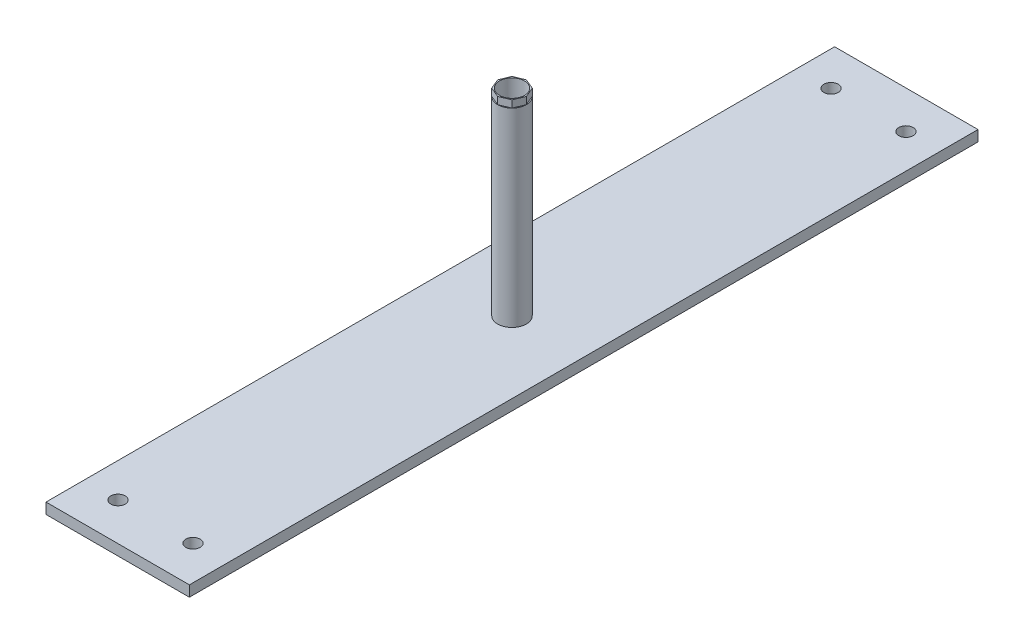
ISO-10303-21;
HEADER;
FILE_DESCRIPTION(('STEP AP214'),'2;1');
FILE_NAME('part.step','',(''),(''),'','','');
FILE_SCHEMA(('AUTOMOTIVE_DESIGN { 1 0 10303 214 1 1 1 1 }'));
ENDSEC;
DATA;
#1=APPLICATION_CONTEXT('core data for automotive mechanical design processes');
#2=APPLICATION_PROTOCOL_DEFINITION('international standard','automotive_design',2000,#1);
#3=PRODUCT_CONTEXT('',#1,'mechanical');
#4=PRODUCT('Part','Part','',(#3));
#5=PRODUCT_RELATED_PRODUCT_CATEGORY('part','',(#4));
#6=PRODUCT_DEFINITION_FORMATION('','',#4);
#7=PRODUCT_DEFINITION_CONTEXT('part definition',#1,'design');
#8=PRODUCT_DEFINITION('design','',#6,#7);
#9=PRODUCT_DEFINITION_SHAPE('','',#8);
#10=(LENGTH_UNIT() NAMED_UNIT(*) SI_UNIT(.MILLI.,.METRE.));
#11=(NAMED_UNIT(*) PLANE_ANGLE_UNIT() SI_UNIT($,.RADIAN.));
#12=(NAMED_UNIT(*) SI_UNIT($,.STERADIAN.) SOLID_ANGLE_UNIT());
#13=UNCERTAINTY_MEASURE_WITH_UNIT(LENGTH_MEASURE(1.E-05),#10,'distance_accuracy_value','');
#14=(GEOMETRIC_REPRESENTATION_CONTEXT(3) GLOBAL_UNCERTAINTY_ASSIGNED_CONTEXT((#13)) GLOBAL_UNIT_ASSIGNED_CONTEXT((#10,
#11,#12)) REPRESENTATION_CONTEXT('',''));
#15=CARTESIAN_POINT('',(0.,0.,0.));
#16=DIRECTION('',(0.,0.,1.));
#17=DIRECTION('',(1.,0.,0.));
#18=AXIS2_PLACEMENT_3D('',#15,#16,#17);
#19=CARTESIAN_POINT('',(0.,29.,0.));
#20=DIRECTION('',(0.,1.,0.));
#21=DIRECTION('',(0.,0.,1.));
#22=AXIS2_PLACEMENT_3D('',#19,#20,#21);
#23=PLANE('',#22);
#24=CARTESIAN_POINT('',(0.,29.,0.));
#25=DIRECTION('',(0.,1.,0.));
#26=DIRECTION('',(0.,0.,1.));
#27=AXIS2_PLACEMENT_3D('',#24,#25,#26);
#28=CIRCLE('',#27,1.75);
#29=CARTESIAN_POINT('',(0.,29.,1.75));
#30=VERTEX_POINT('',#29);
#31=EDGE_CURVE('E222',#30,#30,#28,.T.);
#32=ORIENTED_EDGE('',*,*,#31,.F.);
#33=EDGE_LOOP('',(#32));
#34=FACE_BOUND('',#33,.T.);
#35=DIRECTION('',(-0.382683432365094,0.,-0.923879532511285));
#36=VECTOR('',#35,1.);
#37=CARTESIAN_POINT('',(1.70710678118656,29.,-0.707106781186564));
#38=LINE('',#37,#36);
#39=CARTESIAN_POINT('',(2.00000000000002,29.,0.));
#40=VERTEX_POINT('',#39);
#41=CARTESIAN_POINT('',(1.41421356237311,29.,-1.41421356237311));
#42=VERTEX_POINT('',#41);
#43=EDGE_CURVE('E208',#40,#42,#38,.T.);
#44=ORIENTED_EDGE('',*,*,#43,.T.);
#45=DIRECTION('',(-0.923879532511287,0.,-0.38268343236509));
#46=VECTOR('',#45,1.);
#47=CARTESIAN_POINT('',(0.707106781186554,29.,-1.70710678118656));
#48=LINE('',#47,#46);
#49=CARTESIAN_POINT('',(0.,29.,-2.00000000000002));
#50=VERTEX_POINT('',#49);
#51=EDGE_CURVE('E177',#42,#50,#48,.T.);
#52=ORIENTED_EDGE('',*,*,#51,.T.);
#53=DIRECTION('',(-0.923879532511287,0.,0.38268343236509));
#54=VECTOR('',#53,1.);
#55=CARTESIAN_POINT('',(-0.707106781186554,29.,-1.70710678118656));
#56=LINE('',#55,#54);
#57=CARTESIAN_POINT('',(-1.41421356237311,29.,-1.41421356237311));
#58=VERTEX_POINT('',#57);
#59=EDGE_CURVE('E188',#50,#58,#56,.T.);
#60=ORIENTED_EDGE('',*,*,#59,.T.);
#61=DIRECTION('',(-0.38268343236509,0.,0.923879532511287));
#62=VECTOR('',#61,1.);
#63=CARTESIAN_POINT('',(-1.70710678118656,29.,-0.707106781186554));
#64=LINE('',#63,#62);
#65=CARTESIAN_POINT('',(-2.00000000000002,29.,0.));
#66=VERTEX_POINT('',#65);
#67=EDGE_CURVE('E524',#58,#66,#64,.T.);
#68=ORIENTED_EDGE('',*,*,#67,.T.);
#69=DIRECTION('',(0.38268343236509,0.,0.923879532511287));
#70=VECTOR('',#69,1.);
#71=CARTESIAN_POINT('',(-1.70710678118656,29.,0.707106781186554));
#72=LINE('',#71,#70);
#73=CARTESIAN_POINT('',(-1.41421356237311,29.,1.41421356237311));
#74=VERTEX_POINT('',#73);
#75=EDGE_CURVE('E539',#66,#74,#72,.T.);
#76=ORIENTED_EDGE('',*,*,#75,.T.);
#77=DIRECTION('',(0.923879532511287,0.,0.38268343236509));
#78=VECTOR('',#77,1.);
#79=CARTESIAN_POINT('',(-0.707106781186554,29.,1.70710678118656));
#80=LINE('',#79,#78);
#81=CARTESIAN_POINT('',(0.,29.,2.00000000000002));
#82=VERTEX_POINT('',#81);
#83=EDGE_CURVE('E549',#74,#82,#80,.T.);
#84=ORIENTED_EDGE('',*,*,#83,.T.);
#85=DIRECTION('',(0.923879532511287,0.,-0.38268343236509));
#86=VECTOR('',#85,1.);
#87=CARTESIAN_POINT('',(0.707106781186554,29.,1.70710678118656));
#88=LINE('',#87,#86);
#89=CARTESIAN_POINT('',(1.41421356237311,29.,1.41421356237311));
#90=VERTEX_POINT('',#89);
#91=EDGE_CURVE('E559',#82,#90,#88,.T.);
#92=ORIENTED_EDGE('',*,*,#91,.T.);
#93=DIRECTION('',(0.382683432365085,0.,-0.923879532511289));
#94=VECTOR('',#93,1.);
#95=CARTESIAN_POINT('',(1.70710678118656,29.,0.707106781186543));
#96=LINE('',#95,#94);
#97=EDGE_CURVE('E205',#90,#40,#96,.T.);
#98=ORIENTED_EDGE('',*,*,#97,.T.);
#99=EDGE_LOOP('',(#44,#52,#60,#68,#76,#84,#92,#98));
#100=FACE_BOUND('',#99,.T.);
#101=ADVANCED_FACE('F71',(#34,#100),#23,.T.);
#102=CARTESIAN_POINT('',(0.,29.,0.));
#103=DIRECTION('',(0.,-1.,0.));
#104=DIRECTION('',(0.,0.,-1.));
#105=AXIS2_PLACEMENT_3D('',#102,#103,#104);
#106=CYLINDRICAL_SURFACE('',#105,2.00000000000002);
#107=CARTESIAN_POINT('',(0.,1.5,0.));
#108=DIRECTION('',(0.,-1.,0.));
#109=DIRECTION('',(0.,0.,-1.));
#110=AXIS2_PLACEMENT_3D('',#107,#108,#109);
#111=CIRCLE('',#110,2.00000000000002);
#112=CARTESIAN_POINT('',(0.,1.5,-2.00000000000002));
#113=VERTEX_POINT('',#112);
#114=EDGE_CURVE('E12',#113,#113,#111,.F.);
#115=ORIENTED_EDGE('',*,*,#114,.T.);
#116=EDGE_LOOP('',(#115));
#117=FACE_BOUND('',#116,.T.);
#118=CARTESIAN_POINT('',(0.,28.,0.));
#119=DIRECTION('',(0.,1.,0.));
#120=DIRECTION('',(0.,0.,1.));
#121=AXIS2_PLACEMENT_3D('',#118,#119,#120);
#122=CIRCLE('',#121,2.00000000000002);
#123=CARTESIAN_POINT('',(1.41421356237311,28.,-1.41421356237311));
#124=VERTEX_POINT('',#123);
#125=CARTESIAN_POINT('',(0.,28.,-2.00000000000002));
#126=VERTEX_POINT('',#125);
#127=EDGE_CURVE('E187',#124,#126,#122,.T.);
#128=ORIENTED_EDGE('',*,*,#127,.F.);
#129=CARTESIAN_POINT('',(0.,28.,0.));
#130=DIRECTION('',(0.,1.,0.));
#131=DIRECTION('',(0.,0.,1.));
#132=AXIS2_PLACEMENT_3D('',#129,#130,#131);
#133=CIRCLE('',#132,2.00000000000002);
#134=CARTESIAN_POINT('',(2.00000000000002,28.,0.));
#135=VERTEX_POINT('',#134);
#136=EDGE_CURVE('E182',#135,#124,#133,.T.);
#137=ORIENTED_EDGE('',*,*,#136,.F.);
#138=CARTESIAN_POINT('',(0.,28.,0.));
#139=DIRECTION('',(0.,1.,0.));
#140=DIRECTION('',(0.,0.,1.));
#141=AXIS2_PLACEMENT_3D('',#138,#139,#140);
#142=CIRCLE('',#141,2.00000000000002);
#143=CARTESIAN_POINT('',(1.41421356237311,28.,1.41421356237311));
#144=VERTEX_POINT('',#143);
#145=EDGE_CURVE('E215',#144,#135,#142,.T.);
#146=ORIENTED_EDGE('',*,*,#145,.F.);
#147=CARTESIAN_POINT('',(0.,28.,0.));
#148=DIRECTION('',(0.,1.,0.));
#149=DIRECTION('',(0.,0.,1.));
#150=AXIS2_PLACEMENT_3D('',#147,#148,#149);
#151=CIRCLE('',#150,2.00000000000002);
#152=CARTESIAN_POINT('',(0.,28.,2.00000000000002));
#153=VERTEX_POINT('',#152);
#154=EDGE_CURVE('E85',#153,#144,#151,.T.);
#155=ORIENTED_EDGE('',*,*,#154,.F.);
#156=CARTESIAN_POINT('',(0.,28.,0.));
#157=DIRECTION('',(0.,1.,0.));
#158=DIRECTION('',(0.,0.,1.));
#159=AXIS2_PLACEMENT_3D('',#156,#157,#158);
#160=CIRCLE('',#159,2.00000000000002);
#161=CARTESIAN_POINT('',(-1.41421356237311,28.,1.41421356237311));
#162=VERTEX_POINT('',#161);
#163=EDGE_CURVE('E552',#162,#153,#160,.T.);
#164=ORIENTED_EDGE('',*,*,#163,.F.);
#165=CARTESIAN_POINT('',(0.,28.,0.));
#166=DIRECTION('',(0.,1.,0.));
#167=DIRECTION('',(0.,0.,1.));
#168=AXIS2_PLACEMENT_3D('',#165,#166,#167);
#169=CIRCLE('',#168,2.00000000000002);
#170=CARTESIAN_POINT('',(-2.00000000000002,28.,0.));
#171=VERTEX_POINT('',#170);
#172=EDGE_CURVE('E542',#171,#162,#169,.T.);
#173=ORIENTED_EDGE('',*,*,#172,.F.);
#174=CARTESIAN_POINT('',(0.,28.,0.));
#175=DIRECTION('',(0.,1.,0.));
#176=DIRECTION('',(0.,0.,1.));
#177=AXIS2_PLACEMENT_3D('',#174,#175,#176);
#178=CIRCLE('',#177,2.00000000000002);
#179=CARTESIAN_POINT('',(-1.41421356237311,28.,-1.41421356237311));
#180=VERTEX_POINT('',#179);
#181=EDGE_CURVE('E533',#180,#171,#178,.T.);
#182=ORIENTED_EDGE('',*,*,#181,.F.);
#183=CARTESIAN_POINT('',(0.,28.,0.));
#184=DIRECTION('',(0.,1.,0.));
#185=DIRECTION('',(0.,0.,1.));
#186=AXIS2_PLACEMENT_3D('',#183,#184,#185);
#187=CIRCLE('',#186,2.00000000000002);
#188=EDGE_CURVE('E198',#126,#180,#187,.T.);
#189=ORIENTED_EDGE('',*,*,#188,.F.);
#190=EDGE_LOOP('',(#128,#137,#146,#155,#164,#173,#182,#189));
#191=FACE_BOUND('',#190,.T.);
#192=ADVANCED_FACE('F193',(#117,#191),#106,.T.);
#193=CARTESIAN_POINT('',(0.,1.5,0.));
#194=DIRECTION('',(0.,-1.,0.));
#195=DIRECTION('',(0.,0.,-1.));
#196=AXIS2_PLACEMENT_3D('',#193,#194,#195);
#197=PLANE('',#196);
#198=DIRECTION('',(0.,0.,-1.));
#199=VECTOR('',#198,1.);
#200=CARTESIAN_POINT('',(10.,1.5,55.));
#201=LINE('',#200,#199);
#202=CARTESIAN_POINT('',(10.,1.5,55.));
#203=VERTEX_POINT('',#202);
#204=CARTESIAN_POINT('',(10.,1.5,-55.));
#205=VERTEX_POINT('',#204);
#206=EDGE_CURVE('E254',#203,#205,#201,.T.);
#207=ORIENTED_EDGE('',*,*,#206,.T.);
#208=DIRECTION('',(-1.,0.,0.));
#209=VECTOR('',#208,1.);
#210=CARTESIAN_POINT('',(-10.,1.5,-55.));
#211=LINE('',#210,#209);
#212=CARTESIAN_POINT('',(-10.,1.5,-55.));
#213=VERTEX_POINT('',#212);
#214=EDGE_CURVE('E123',#205,#213,#211,.T.);
#215=ORIENTED_EDGE('',*,*,#214,.T.);
#216=DIRECTION('',(0.,0.,1.));
#217=VECTOR('',#216,1.);
#218=CARTESIAN_POINT('',(-10.,1.5,55.));
#219=LINE('',#218,#217);
#220=CARTESIAN_POINT('',(-10.,1.5,55.));
#221=VERTEX_POINT('',#220);
#222=EDGE_CURVE('E257',#213,#221,#219,.T.);
#223=ORIENTED_EDGE('',*,*,#222,.T.);
#224=DIRECTION('',(1.,0.,0.));
#225=VECTOR('',#224,1.);
#226=CARTESIAN_POINT('',(-10.,1.5,55.));
#227=LINE('',#226,#225);
#228=EDGE_CURVE('E94',#221,#203,#227,.T.);
#229=ORIENTED_EDGE('',*,*,#228,.T.);
#230=EDGE_LOOP('',(#207,#215,#223,#229));
#231=FACE_BOUND('',#230,.T.);
#232=CARTESIAN_POINT('',(-5.22642316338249,1.5,-49.7260947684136));
#233=DIRECTION('',(0.,1.,0.));
#234=DIRECTION('',(0.,0.,1.));
#235=AXIS2_PLACEMENT_3D('',#232,#233,#234);
#236=CIRCLE('',#235,1.);
#237=CARTESIAN_POINT('',(-5.22642316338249,1.5,-48.7260947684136));
#238=VERTEX_POINT('',#237);
#239=EDGE_CURVE('E247',#238,#238,#236,.T.);
#240=ORIENTED_EDGE('',*,*,#239,.F.);
#241=EDGE_LOOP('',(#240));
#242=FACE_BOUND('',#241,.T.);
#243=CARTESIAN_POINT('',(5.22642316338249,1.5,-49.7260947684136));
#244=DIRECTION('',(0.,1.,0.));
#245=DIRECTION('',(0.,0.,1.));
#246=AXIS2_PLACEMENT_3D('',#243,#244,#245);
#247=CIRCLE('',#246,1.);
#248=CARTESIAN_POINT('',(5.22642316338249,1.5,-48.7260947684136));
#249=VERTEX_POINT('',#248);
#250=EDGE_CURVE('E241',#249,#249,#247,.T.);
#251=ORIENTED_EDGE('',*,*,#250,.F.);
#252=EDGE_LOOP('',(#251));
#253=FACE_BOUND('',#252,.T.);
#254=CARTESIAN_POINT('',(5.22642316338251,1.5,49.7260947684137));
#255=DIRECTION('',(0.,1.,0.));
#256=DIRECTION('',(0.,0.,1.));
#257=AXIS2_PLACEMENT_3D('',#254,#255,#256);
#258=CIRCLE('',#257,1.);
#259=CARTESIAN_POINT('',(5.22642316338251,1.5,50.7260947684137));
#260=VERTEX_POINT('',#259);
#261=EDGE_CURVE('E235',#260,#260,#258,.T.);
#262=ORIENTED_EDGE('',*,*,#261,.F.);
#263=EDGE_LOOP('',(#262));
#264=FACE_BOUND('',#263,.T.);
#265=CARTESIAN_POINT('',(-5.22642316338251,1.5,49.7260947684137));
#266=DIRECTION('',(0.,1.,0.));
#267=DIRECTION('',(0.,0.,1.));
#268=AXIS2_PLACEMENT_3D('',#265,#266,#267);
#269=CIRCLE('',#268,1.);
#270=CARTESIAN_POINT('',(-5.22642316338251,1.5,50.7260947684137));
#271=VERTEX_POINT('',#270);
#272=EDGE_CURVE('E229',#271,#271,#269,.T.);
#273=ORIENTED_EDGE('',*,*,#272,.F.);
#274=EDGE_LOOP('',(#273));
#275=FACE_BOUND('',#274,.T.);
#276=ORIENTED_EDGE('',*,*,#114,.F.);
#277=EDGE_LOOP('',(#276));
#278=FACE_BOUND('',#277,.T.);
#279=ADVANCED_FACE('F286',(#231,#242,#253,#264,#275,#278),#197,.F.);
#280=CARTESIAN_POINT('',(10.,1.5,55.));
#281=DIRECTION('',(-1.,0.,0.));
#282=DIRECTION('',(0.,0.,1.));
#283=AXIS2_PLACEMENT_3D('',#280,#281,#282);
#284=PLANE('',#283);
#285=DIRECTION('',(0.,0.,-1.));
#286=VECTOR('',#285,1.);
#287=CARTESIAN_POINT('',(10.,0.,55.));
#288=LINE('',#287,#286);
#289=CARTESIAN_POINT('',(10.,0.,55.));
#290=VERTEX_POINT('',#289);
#291=CARTESIAN_POINT('',(10.,0.,-55.));
#292=VERTEX_POINT('',#291);
#293=EDGE_CURVE('E253',#290,#292,#288,.T.);
#294=ORIENTED_EDGE('',*,*,#293,.T.);
#295=DIRECTION('',(0.,-1.,0.));
#296=VECTOR('',#295,1.);
#297=CARTESIAN_POINT('',(10.,1.5,-55.));
#298=LINE('',#297,#296);
#299=EDGE_CURVE('E79',#205,#292,#298,.T.);
#300=ORIENTED_EDGE('',*,*,#299,.F.);
#301=ORIENTED_EDGE('',*,*,#206,.F.);
#302=DIRECTION('',(0.,-1.,0.));
#303=VECTOR('',#302,1.);
#304=CARTESIAN_POINT('',(10.,1.5,55.));
#305=LINE('',#304,#303);
#306=EDGE_CURVE('E260',#203,#290,#305,.T.);
#307=ORIENTED_EDGE('',*,*,#306,.T.);
#308=EDGE_LOOP('',(#294,#300,#301,#307));
#309=FACE_BOUND('',#308,.T.);
#310=ADVANCED_FACE('F73',(#309),#284,.F.);
#311=CARTESIAN_POINT('',(-10.,1.5,-55.));
#312=DIRECTION('',(0.,0.,1.));
#313=DIRECTION('',(1.,0.,0.));
#314=AXIS2_PLACEMENT_3D('',#311,#312,#313);
#315=PLANE('',#314);
#316=DIRECTION('',(-1.,0.,0.));
#317=VECTOR('',#316,1.);
#318=CARTESIAN_POINT('',(-10.,0.,-55.));
#319=LINE('',#318,#317);
#320=CARTESIAN_POINT('',(-10.,0.,-55.));
#321=VERTEX_POINT('',#320);
#322=EDGE_CURVE('E263',#292,#321,#319,.T.);
#323=ORIENTED_EDGE('',*,*,#322,.T.);
#324=DIRECTION('',(0.,-1.,0.));
#325=VECTOR('',#324,1.);
#326=CARTESIAN_POINT('',(-10.,1.5,-55.));
#327=LINE('',#326,#325);
#328=EDGE_CURVE('E271',#213,#321,#327,.T.);
#329=ORIENTED_EDGE('',*,*,#328,.F.);
#330=ORIENTED_EDGE('',*,*,#214,.F.);
#331=ORIENTED_EDGE('',*,*,#299,.T.);
#332=EDGE_LOOP('',(#323,#329,#330,#331));
#333=FACE_BOUND('',#332,.T.);
#334=ADVANCED_FACE('F274',(#333),#315,.F.);
#335=CARTESIAN_POINT('',(-10.,1.5,55.));
#336=DIRECTION('',(1.,0.,0.));
#337=DIRECTION('',(0.,0.,-1.));
#338=AXIS2_PLACEMENT_3D('',#335,#336,#337);
#339=PLANE('',#338);
#340=DIRECTION('',(0.,0.,1.));
#341=VECTOR('',#340,1.);
#342=CARTESIAN_POINT('',(-10.,0.,55.));
#343=LINE('',#342,#341);
#344=CARTESIAN_POINT('',(-10.,0.,55.));
#345=VERTEX_POINT('',#344);
#346=EDGE_CURVE('E265',#321,#345,#343,.T.);
#347=ORIENTED_EDGE('',*,*,#346,.T.);
#348=DIRECTION('',(0.,-1.,0.));
#349=VECTOR('',#348,1.);
#350=CARTESIAN_POINT('',(-10.,1.5,55.));
#351=LINE('',#350,#349);
#352=EDGE_CURVE('E269',#221,#345,#351,.T.);
#353=ORIENTED_EDGE('',*,*,#352,.F.);
#354=ORIENTED_EDGE('',*,*,#222,.F.);
#355=ORIENTED_EDGE('',*,*,#328,.T.);
#356=EDGE_LOOP('',(#347,#353,#354,#355));
#357=FACE_BOUND('',#356,.T.);
#358=ADVANCED_FACE('F283',(#357),#339,.F.);
#359=CARTESIAN_POINT('',(-10.,1.5,55.));
#360=DIRECTION('',(0.,0.,-1.));
#361=DIRECTION('',(-1.,0.,0.));
#362=AXIS2_PLACEMENT_3D('',#359,#360,#361);
#363=PLANE('',#362);
#364=DIRECTION('',(1.,0.,0.));
#365=VECTOR('',#364,1.);
#366=CARTESIAN_POINT('',(-10.,0.,55.));
#367=LINE('',#366,#365);
#368=EDGE_CURVE('E115',#345,#290,#367,.T.);
#369=ORIENTED_EDGE('',*,*,#368,.T.);
#370=ORIENTED_EDGE('',*,*,#306,.F.);
#371=ORIENTED_EDGE('',*,*,#228,.F.);
#372=ORIENTED_EDGE('',*,*,#352,.T.);
#373=EDGE_LOOP('',(#369,#370,#371,#372));
#374=FACE_BOUND('',#373,.T.);
#375=ADVANCED_FACE('F285',(#374),#363,.F.);
#376=CARTESIAN_POINT('',(0.,0.,0.));
#377=DIRECTION('',(0.,-1.,0.));
#378=DIRECTION('',(0.,0.,-1.));
#379=AXIS2_PLACEMENT_3D('',#376,#377,#378);
#380=PLANE('',#379);
#381=CARTESIAN_POINT('',(0.,0.,0.));
#382=DIRECTION('',(0.,-1.,0.));
#383=DIRECTION('',(0.,0.,-1.));
#384=AXIS2_PLACEMENT_3D('',#381,#382,#383);
#385=CIRCLE('',#384,1.75);
#386=CARTESIAN_POINT('',(0.,0.,-1.74999999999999));
#387=VERTEX_POINT('',#386);
#388=EDGE_CURVE('E226',#387,#387,#385,.F.);
#389=ORIENTED_EDGE('',*,*,#388,.T.);
#390=EDGE_LOOP('',(#389));
#391=FACE_BOUND('',#390,.T.);
#392=CARTESIAN_POINT('',(-5.22642316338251,0.,49.7260947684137));
#393=DIRECTION('',(0.,-1.,0.));
#394=DIRECTION('',(0.,0.,-1.));
#395=AXIS2_PLACEMENT_3D('',#392,#393,#394);
#396=CIRCLE('',#395,1.);
#397=CARTESIAN_POINT('',(-5.22642316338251,0.,48.7260947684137));
#398=VERTEX_POINT('',#397);
#399=EDGE_CURVE('E232',#398,#398,#396,.F.);
#400=ORIENTED_EDGE('',*,*,#399,.T.);
#401=EDGE_LOOP('',(#400));
#402=FACE_BOUND('',#401,.T.);
#403=CARTESIAN_POINT('',(5.22642316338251,0.,49.7260947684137));
#404=DIRECTION('',(0.,-1.,0.));
#405=DIRECTION('',(0.,0.,-1.));
#406=AXIS2_PLACEMENT_3D('',#403,#404,#405);
#407=CIRCLE('',#406,1.);
#408=CARTESIAN_POINT('',(5.22642316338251,0.,48.7260947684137));
#409=VERTEX_POINT('',#408);
#410=EDGE_CURVE('E238',#409,#409,#407,.F.);
#411=ORIENTED_EDGE('',*,*,#410,.T.);
#412=EDGE_LOOP('',(#411));
#413=FACE_BOUND('',#412,.T.);
#414=CARTESIAN_POINT('',(5.22642316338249,0.,-49.7260947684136));
#415=DIRECTION('',(0.,-1.,0.));
#416=DIRECTION('',(0.,0.,-1.));
#417=AXIS2_PLACEMENT_3D('',#414,#415,#416);
#418=CIRCLE('',#417,1.);
#419=CARTESIAN_POINT('',(5.22642316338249,0.,-50.7260947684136));
#420=VERTEX_POINT('',#419);
#421=EDGE_CURVE('E244',#420,#420,#418,.F.);
#422=ORIENTED_EDGE('',*,*,#421,.T.);
#423=EDGE_LOOP('',(#422));
#424=FACE_BOUND('',#423,.T.);
#425=CARTESIAN_POINT('',(-5.22642316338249,0.,-49.7260947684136));
#426=DIRECTION('',(0.,-1.,0.));
#427=DIRECTION('',(0.,0.,-1.));
#428=AXIS2_PLACEMENT_3D('',#425,#426,#427);
#429=CIRCLE('',#428,1.);
#430=CARTESIAN_POINT('',(-5.22642316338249,0.,-50.7260947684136));
#431=VERTEX_POINT('',#430);
#432=EDGE_CURVE('E250',#431,#431,#429,.F.);
#433=ORIENTED_EDGE('',*,*,#432,.T.);
#434=EDGE_LOOP('',(#433));
#435=FACE_BOUND('',#434,.T.);
#436=ORIENTED_EDGE('',*,*,#293,.F.);
#437=ORIENTED_EDGE('',*,*,#368,.F.);
#438=ORIENTED_EDGE('',*,*,#346,.F.);
#439=ORIENTED_EDGE('',*,*,#322,.F.);
#440=EDGE_LOOP('',(#436,#437,#438,#439));
#441=FACE_BOUND('',#440,.T.);
#442=ADVANCED_FACE('F279',(#391,#402,#413,#424,#435,#441),#380,.T.);
#443=CARTESIAN_POINT('',(-5.22642316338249,-4.94974746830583,-49.7260947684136));
#444=DIRECTION('',(0.,1.,0.));
#445=DIRECTION('',(0.,0.,1.));
#446=AXIS2_PLACEMENT_3D('',#443,#444,#445);
#447=CYLINDRICAL_SURFACE('',#446,1.);
#448=ORIENTED_EDGE('',*,*,#239,.T.);
#449=EDGE_LOOP('',(#448));
#450=FACE_BOUND('',#449,.T.);
#451=ORIENTED_EDGE('',*,*,#432,.F.);
#452=EDGE_LOOP('',(#451));
#453=FACE_BOUND('',#452,.T.);
#454=ADVANCED_FACE('F325',(#450,#453),#447,.F.);
#455=CARTESIAN_POINT('',(5.22642316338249,-4.94974746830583,-49.7260947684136));
#456=DIRECTION('',(0.,1.,0.));
#457=DIRECTION('',(0.,0.,1.));
#458=AXIS2_PLACEMENT_3D('',#455,#456,#457);
#459=CYLINDRICAL_SURFACE('',#458,1.);
#460=ORIENTED_EDGE('',*,*,#250,.T.);
#461=EDGE_LOOP('',(#460));
#462=FACE_BOUND('',#461,.T.);
#463=ORIENTED_EDGE('',*,*,#421,.F.);
#464=EDGE_LOOP('',(#463));
#465=FACE_BOUND('',#464,.T.);
#466=ADVANCED_FACE('F321',(#462,#465),#459,.F.);
#467=CARTESIAN_POINT('',(5.22642316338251,-4.94974746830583,49.7260947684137));
#468=DIRECTION('',(0.,1.,0.));
#469=DIRECTION('',(0.,0.,1.));
#470=AXIS2_PLACEMENT_3D('',#467,#468,#469);
#471=CYLINDRICAL_SURFACE('',#470,1.);
#472=ORIENTED_EDGE('',*,*,#261,.T.);
#473=EDGE_LOOP('',(#472));
#474=FACE_BOUND('',#473,.T.);
#475=ORIENTED_EDGE('',*,*,#410,.F.);
#476=EDGE_LOOP('',(#475));
#477=FACE_BOUND('',#476,.T.);
#478=ADVANCED_FACE('F317',(#474,#477),#471,.F.);
#479=CARTESIAN_POINT('',(-5.22642316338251,-4.94974746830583,49.7260947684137));
#480=DIRECTION('',(0.,1.,0.));
#481=DIRECTION('',(0.,0.,1.));
#482=AXIS2_PLACEMENT_3D('',#479,#480,#481);
#483=CYLINDRICAL_SURFACE('',#482,1.);
#484=ORIENTED_EDGE('',*,*,#272,.T.);
#485=EDGE_LOOP('',(#484));
#486=FACE_BOUND('',#485,.T.);
#487=ORIENTED_EDGE('',*,*,#399,.F.);
#488=EDGE_LOOP('',(#487));
#489=FACE_BOUND('',#488,.T.);
#490=ADVANCED_FACE('F313',(#486,#489),#483,.F.);
#491=CARTESIAN_POINT('',(0.,-4.94974746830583,0.));
#492=DIRECTION('',(0.,1.,0.));
#493=DIRECTION('',(0.,0.,1.));
#494=AXIS2_PLACEMENT_3D('',#491,#492,#493);
#495=CYLINDRICAL_SURFACE('',#494,1.75);
#496=ORIENTED_EDGE('',*,*,#388,.F.);
#497=EDGE_LOOP('',(#496));
#498=FACE_BOUND('',#497,.T.);
#499=ORIENTED_EDGE('',*,*,#31,.T.);
#500=EDGE_LOOP('',(#499));
#501=FACE_BOUND('',#500,.T.);
#502=ADVANCED_FACE('F309',(#498,#501),#495,.F.);
#503=CARTESIAN_POINT('',(1.70710678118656,28.,0.707106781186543));
#504=DIRECTION('',(0.923879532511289,0.,0.382683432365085));
#505=DIRECTION('',(0.382683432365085,0.,-0.923879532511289));
#506=AXIS2_PLACEMENT_3D('',#503,#504,#505);
#507=PLANE('',#506);
#508=ORIENTED_EDGE('',*,*,#97,.F.);
#509=DIRECTION('',(0.,1.,0.));
#510=VECTOR('',#509,1.);
#511=CARTESIAN_POINT('',(1.41421356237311,28.,1.41421356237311));
#512=LINE('',#511,#510);
#513=EDGE_CURVE('E218',#144,#90,#512,.T.);
#514=ORIENTED_EDGE('',*,*,#513,.F.);
#515=DIRECTION('',(0.382683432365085,0.,-0.923879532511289));
#516=VECTOR('',#515,1.);
#517=CARTESIAN_POINT('',(1.70710678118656,28.,0.707106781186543));
#518=LINE('',#517,#516);
#519=EDGE_CURVE('E213',#144,#135,#518,.T.);
#520=ORIENTED_EDGE('',*,*,#519,.T.);
#521=DIRECTION('',(0.,1.,0.));
#522=VECTOR('',#521,1.);
#523=CARTESIAN_POINT('',(2.00000000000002,28.,0.));
#524=LINE('',#523,#522);
#525=EDGE_CURVE('E203',#135,#40,#524,.T.);
#526=ORIENTED_EDGE('',*,*,#525,.T.);
#527=EDGE_LOOP('',(#508,#514,#520,#526));
#528=FACE_BOUND('',#527,.T.);
#529=ADVANCED_FACE('F312',(#528),#507,.T.);
#530=CARTESIAN_POINT('',(0.,28.,0.));
#531=DIRECTION('',(0.,1.,0.));
#532=DIRECTION('',(0.,0.,1.));
#533=AXIS2_PLACEMENT_3D('',#530,#531,#532);
#534=PLANE('',#533);
#535=ORIENTED_EDGE('',*,*,#519,.F.);
#536=ORIENTED_EDGE('',*,*,#145,.T.);
#537=EDGE_LOOP('',(#535,#536));
#538=FACE_BOUND('',#537,.T.);
#539=ADVANCED_FACE('F376',(#538),#534,.T.);
#540=CARTESIAN_POINT('',(1.70710678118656,28.,-0.707106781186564));
#541=DIRECTION('',(0.923879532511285,0.,-0.382683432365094));
#542=DIRECTION('',(-0.382683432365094,0.,-0.923879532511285));
#543=AXIS2_PLACEMENT_3D('',#540,#541,#542);
#544=PLANE('',#543);
#545=ORIENTED_EDGE('',*,*,#43,.F.);
#546=ORIENTED_EDGE('',*,*,#525,.F.);
#547=DIRECTION('',(-0.382683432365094,0.,-0.923879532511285));
#548=VECTOR('',#547,1.);
#549=CARTESIAN_POINT('',(1.70710678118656,28.,-0.707106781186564));
#550=LINE('',#549,#548);
#551=EDGE_CURVE('E181',#135,#124,#550,.T.);
#552=ORIENTED_EDGE('',*,*,#551,.T.);
#553=DIRECTION('',(0.,1.,0.));
#554=VECTOR('',#553,1.);
#555=CARTESIAN_POINT('',(1.41421356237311,28.,-1.41421356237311));
#556=LINE('',#555,#554);
#557=EDGE_CURVE('E171',#124,#42,#556,.T.);
#558=ORIENTED_EDGE('',*,*,#557,.T.);
#559=EDGE_LOOP('',(#545,#546,#552,#558));
#560=FACE_BOUND('',#559,.T.);
#561=ADVANCED_FACE('F201',(#560),#544,.T.);
#562=CARTESIAN_POINT('',(0.,28.,0.));
#563=DIRECTION('',(0.,1.,0.));
#564=DIRECTION('',(0.,0.,1.));
#565=AXIS2_PLACEMENT_3D('',#562,#563,#564);
#566=PLANE('',#565);
#567=ORIENTED_EDGE('',*,*,#551,.F.);
#568=ORIENTED_EDGE('',*,*,#136,.T.);
#569=EDGE_LOOP('',(#567,#568));
#570=FACE_BOUND('',#569,.T.);
#571=ADVANCED_FACE('F207',(#570),#566,.T.);
#572=CARTESIAN_POINT('',(0.707106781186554,28.,1.70710678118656));
#573=DIRECTION('',(0.38268343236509,0.,0.923879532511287));
#574=DIRECTION('',(0.923879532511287,0.,-0.38268343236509));
#575=AXIS2_PLACEMENT_3D('',#572,#573,#574);
#576=PLANE('',#575);
#577=ORIENTED_EDGE('',*,*,#91,.F.);
#578=DIRECTION('',(0.,1.,0.));
#579=VECTOR('',#578,1.);
#580=CARTESIAN_POINT('',(0.,28.,2.00000000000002));
#581=LINE('',#580,#579);
#582=EDGE_CURVE('E560',#153,#82,#581,.T.);
#583=ORIENTED_EDGE('',*,*,#582,.F.);
#584=DIRECTION('',(0.923879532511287,0.,-0.38268343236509));
#585=VECTOR('',#584,1.);
#586=CARTESIAN_POINT('',(0.707106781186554,28.,1.70710678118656));
#587=LINE('',#586,#585);
#588=EDGE_CURVE('E210',#153,#144,#587,.T.);
#589=ORIENTED_EDGE('',*,*,#588,.T.);
#590=ORIENTED_EDGE('',*,*,#513,.T.);
#591=EDGE_LOOP('',(#577,#583,#589,#590));
#592=FACE_BOUND('',#591,.T.);
#593=ADVANCED_FACE('F402',(#592),#576,.T.);
#594=CARTESIAN_POINT('',(0.,28.,0.));
#595=DIRECTION('',(0.,1.,0.));
#596=DIRECTION('',(0.,0.,1.));
#597=AXIS2_PLACEMENT_3D('',#594,#595,#596);
#598=PLANE('',#597);
#599=ORIENTED_EDGE('',*,*,#588,.F.);
#600=ORIENTED_EDGE('',*,*,#154,.T.);
#601=EDGE_LOOP('',(#599,#600));
#602=FACE_BOUND('',#601,.T.);
#603=ADVANCED_FACE('F411',(#602),#598,.T.);
#604=CARTESIAN_POINT('',(-0.707106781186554,28.,1.70710678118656));
#605=DIRECTION('',(-0.38268343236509,0.,0.923879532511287));
#606=DIRECTION('',(0.923879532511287,0.,0.38268343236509));
#607=AXIS2_PLACEMENT_3D('',#604,#605,#606);
#608=PLANE('',#607);
#609=ORIENTED_EDGE('',*,*,#83,.F.);
#610=DIRECTION('',(0.,1.,0.));
#611=VECTOR('',#610,1.);
#612=CARTESIAN_POINT('',(-1.41421356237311,28.,1.41421356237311));
#613=LINE('',#612,#611);
#614=EDGE_CURVE('E550',#162,#74,#613,.T.);
#615=ORIENTED_EDGE('',*,*,#614,.F.);
#616=DIRECTION('',(0.923879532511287,0.,0.38268343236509));
#617=VECTOR('',#616,1.);
#618=CARTESIAN_POINT('',(-0.707106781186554,28.,1.70710678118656));
#619=LINE('',#618,#617);
#620=EDGE_CURVE('E556',#162,#153,#619,.T.);
#621=ORIENTED_EDGE('',*,*,#620,.T.);
#622=ORIENTED_EDGE('',*,*,#582,.T.);
#623=EDGE_LOOP('',(#609,#615,#621,#622));
#624=FACE_BOUND('',#623,.T.);
#625=ADVANCED_FACE('F421',(#624),#608,.T.);
#626=CARTESIAN_POINT('',(0.,28.,0.));
#627=DIRECTION('',(0.,1.,0.));
#628=DIRECTION('',(0.,0.,1.));
#629=AXIS2_PLACEMENT_3D('',#626,#627,#628);
#630=PLANE('',#629);
#631=ORIENTED_EDGE('',*,*,#620,.F.);
#632=ORIENTED_EDGE('',*,*,#163,.T.);
#633=EDGE_LOOP('',(#631,#632));
#634=FACE_BOUND('',#633,.T.);
#635=ADVANCED_FACE('F430',(#634),#630,.T.);
#636=CARTESIAN_POINT('',(-1.70710678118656,28.,0.707106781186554));
#637=DIRECTION('',(-0.923879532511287,0.,0.38268343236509));
#638=DIRECTION('',(0.38268343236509,0.,0.923879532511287));
#639=AXIS2_PLACEMENT_3D('',#636,#637,#638);
#640=PLANE('',#639);
#641=ORIENTED_EDGE('',*,*,#75,.F.);
#642=DIRECTION('',(0.,1.,0.));
#643=VECTOR('',#642,1.);
#644=CARTESIAN_POINT('',(-2.00000000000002,28.,0.));
#645=LINE('',#644,#643);
#646=EDGE_CURVE('E540',#171,#66,#645,.T.);
#647=ORIENTED_EDGE('',*,*,#646,.F.);
#648=DIRECTION('',(0.38268343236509,0.,0.923879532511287));
#649=VECTOR('',#648,1.);
#650=CARTESIAN_POINT('',(-1.70710678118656,28.,0.707106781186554));
#651=LINE('',#650,#649);
#652=EDGE_CURVE('E546',#171,#162,#651,.T.);
#653=ORIENTED_EDGE('',*,*,#652,.T.);
#654=ORIENTED_EDGE('',*,*,#614,.T.);
#655=EDGE_LOOP('',(#641,#647,#653,#654));
#656=FACE_BOUND('',#655,.T.);
#657=ADVANCED_FACE('F440',(#656),#640,.T.);
#658=CARTESIAN_POINT('',(0.,28.,0.));
#659=DIRECTION('',(0.,1.,0.));
#660=DIRECTION('',(0.,0.,1.));
#661=AXIS2_PLACEMENT_3D('',#658,#659,#660);
#662=PLANE('',#661);
#663=ORIENTED_EDGE('',*,*,#652,.F.);
#664=ORIENTED_EDGE('',*,*,#172,.T.);
#665=EDGE_LOOP('',(#663,#664));
#666=FACE_BOUND('',#665,.T.);
#667=ADVANCED_FACE('F450',(#666),#662,.T.);
#668=CARTESIAN_POINT('',(-1.70710678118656,28.,-0.707106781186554));
#669=DIRECTION('',(-0.923879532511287,0.,-0.38268343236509));
#670=DIRECTION('',(-0.38268343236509,0.,0.923879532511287));
#671=AXIS2_PLACEMENT_3D('',#668,#669,#670);
#672=PLANE('',#671);
#673=ORIENTED_EDGE('',*,*,#67,.F.);
#674=DIRECTION('',(0.,1.,0.));
#675=VECTOR('',#674,1.);
#676=CARTESIAN_POINT('',(-1.41421356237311,28.,-1.41421356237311));
#677=LINE('',#676,#675);
#678=EDGE_CURVE('E527',#180,#58,#677,.T.);
#679=ORIENTED_EDGE('',*,*,#678,.F.);
#680=DIRECTION('',(-0.38268343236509,0.,0.923879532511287));
#681=VECTOR('',#680,1.);
#682=CARTESIAN_POINT('',(-1.70710678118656,28.,-0.707106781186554));
#683=LINE('',#682,#681);
#684=EDGE_CURVE('E536',#180,#171,#683,.T.);
#685=ORIENTED_EDGE('',*,*,#684,.T.);
#686=ORIENTED_EDGE('',*,*,#646,.T.);
#687=EDGE_LOOP('',(#673,#679,#685,#686));
#688=FACE_BOUND('',#687,.T.);
#689=ADVANCED_FACE('F460',(#688),#672,.T.);
#690=CARTESIAN_POINT('',(0.,28.,0.));
#691=DIRECTION('',(0.,1.,0.));
#692=DIRECTION('',(0.,0.,1.));
#693=AXIS2_PLACEMENT_3D('',#690,#691,#692);
#694=PLANE('',#693);
#695=ORIENTED_EDGE('',*,*,#684,.F.);
#696=ORIENTED_EDGE('',*,*,#181,.T.);
#697=EDGE_LOOP('',(#695,#696));
#698=FACE_BOUND('',#697,.T.);
#699=ADVANCED_FACE('F470',(#698),#694,.T.);
#700=CARTESIAN_POINT('',(-0.707106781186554,28.,-1.70710678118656));
#701=DIRECTION('',(-0.38268343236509,0.,-0.923879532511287));
#702=DIRECTION('',(-0.923879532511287,0.,0.38268343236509));
#703=AXIS2_PLACEMENT_3D('',#700,#701,#702);
#704=PLANE('',#703);
#705=ORIENTED_EDGE('',*,*,#59,.F.);
#706=DIRECTION('',(0.,1.,0.));
#707=VECTOR('',#706,1.);
#708=CARTESIAN_POINT('',(0.,28.,-2.00000000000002));
#709=LINE('',#708,#707);
#710=EDGE_CURVE('E529',#126,#50,#709,.T.);
#711=ORIENTED_EDGE('',*,*,#710,.F.);
#712=DIRECTION('',(-0.923879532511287,0.,0.38268343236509));
#713=VECTOR('',#712,1.);
#714=CARTESIAN_POINT('',(-0.707106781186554,28.,-1.70710678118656));
#715=LINE('',#714,#713);
#716=EDGE_CURVE('E522',#126,#180,#715,.T.);
#717=ORIENTED_EDGE('',*,*,#716,.T.);
#718=ORIENTED_EDGE('',*,*,#678,.T.);
#719=EDGE_LOOP('',(#705,#711,#717,#718));
#720=FACE_BOUND('',#719,.T.);
#721=ADVANCED_FACE('F480',(#720),#704,.T.);
#722=CARTESIAN_POINT('',(0.,28.,0.));
#723=DIRECTION('',(0.,1.,0.));
#724=DIRECTION('',(0.,0.,1.));
#725=AXIS2_PLACEMENT_3D('',#722,#723,#724);
#726=PLANE('',#725);
#727=ORIENTED_EDGE('',*,*,#716,.F.);
#728=ORIENTED_EDGE('',*,*,#188,.T.);
#729=EDGE_LOOP('',(#727,#728));
#730=FACE_BOUND('',#729,.T.);
#731=ADVANCED_FACE('F490',(#730),#726,.T.);
#732=CARTESIAN_POINT('',(0.707106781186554,28.,-1.70710678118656));
#733=DIRECTION('',(0.38268343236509,0.,-0.923879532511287));
#734=DIRECTION('',(-0.923879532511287,0.,-0.38268343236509));
#735=AXIS2_PLACEMENT_3D('',#732,#733,#734);
#736=PLANE('',#735);
#737=ORIENTED_EDGE('',*,*,#51,.F.);
#738=ORIENTED_EDGE('',*,*,#557,.F.);
#739=DIRECTION('',(-0.923879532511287,0.,-0.38268343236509));
#740=VECTOR('',#739,1.);
#741=CARTESIAN_POINT('',(0.707106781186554,28.,-1.70710678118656));
#742=LINE('',#741,#740);
#743=EDGE_CURVE('E174',#124,#126,#742,.T.);
#744=ORIENTED_EDGE('',*,*,#743,.T.);
#745=ORIENTED_EDGE('',*,*,#710,.T.);
#746=EDGE_LOOP('',(#737,#738,#744,#745));
#747=FACE_BOUND('',#746,.T.);
#748=ADVANCED_FACE('F173',(#747),#736,.T.);
#749=CARTESIAN_POINT('',(0.,28.,0.));
#750=DIRECTION('',(0.,1.,0.));
#751=DIRECTION('',(0.,0.,1.));
#752=AXIS2_PLACEMENT_3D('',#749,#750,#751);
#753=PLANE('',#752);
#754=ORIENTED_EDGE('',*,*,#743,.F.);
#755=ORIENTED_EDGE('',*,*,#127,.T.);
#756=EDGE_LOOP('',(#754,#755));
#757=FACE_BOUND('',#756,.T.);
#758=ADVANCED_FACE('F186',(#757),#753,.T.);
#759=CLOSED_SHELL('',(#101,#192,#279,#310,#334,#358,#375,#442,#454,#466,#478,#490,#502,#529,
#539,#561,#571,#593,#603,#625,#635,#657,#667,#689,#699,#721,#731,#748,#758));
#760=MANIFOLD_SOLID_BREP('B2',#759);
#761=ADVANCED_BREP_SHAPE_REPRESENTATION('',(#18,#760),#14);
#762=SHAPE_DEFINITION_REPRESENTATION(#9,#761);
ENDSEC;
END-ISO-10303-21;
